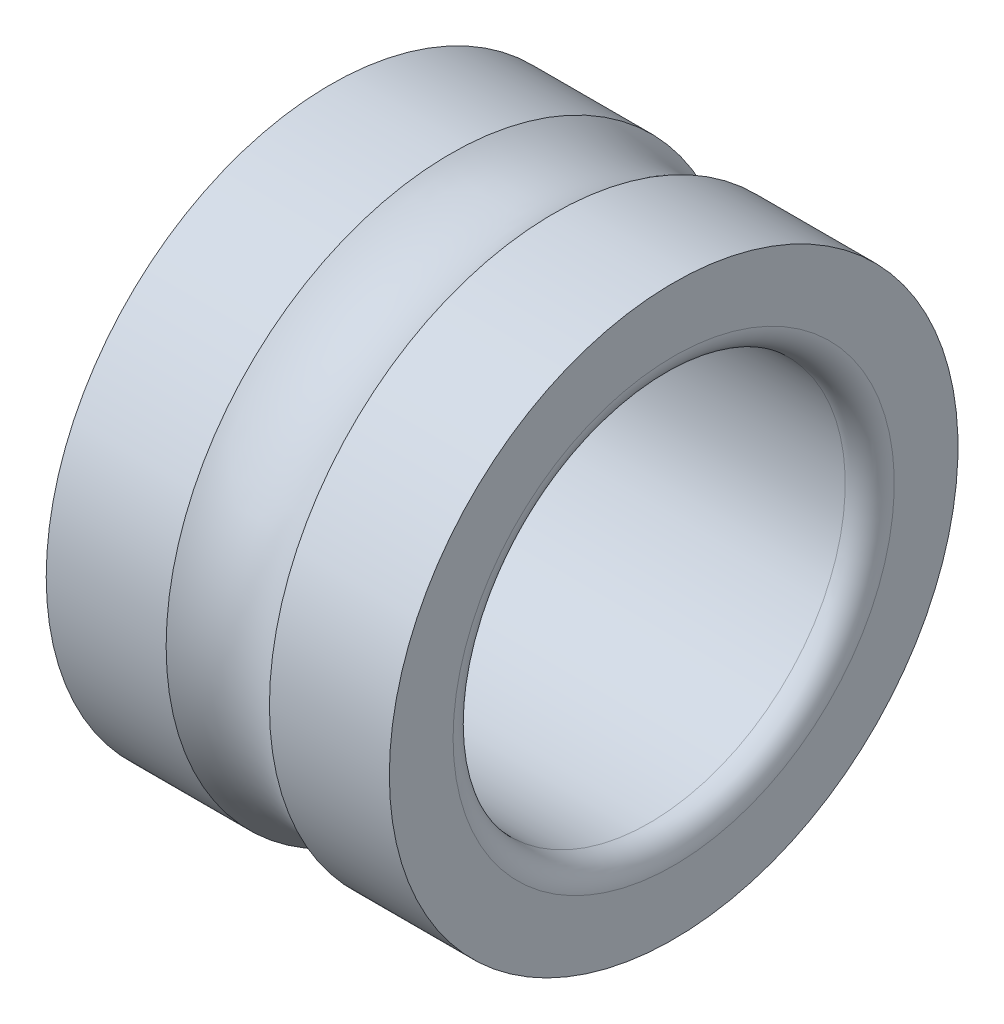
ISO-10303-21;
HEADER;
FILE_DESCRIPTION(('STEP AP214'),'2;1');
FILE_NAME('part.step','',(''),(''),'','','');
FILE_SCHEMA(('AUTOMOTIVE_DESIGN { 1 0 10303 214 1 1 1 1 }'));
ENDSEC;
DATA;
#1=APPLICATION_CONTEXT('core data for automotive mechanical design processes');
#2=APPLICATION_PROTOCOL_DEFINITION('international standard','automotive_design',2000,#1);
#3=PRODUCT_CONTEXT('',#1,'mechanical');
#4=PRODUCT('Part','Part','',(#3));
#5=PRODUCT_RELATED_PRODUCT_CATEGORY('part','',(#4));
#6=PRODUCT_DEFINITION_FORMATION('','',#4);
#7=PRODUCT_DEFINITION_CONTEXT('part definition',#1,'design');
#8=PRODUCT_DEFINITION('design','',#6,#7);
#9=PRODUCT_DEFINITION_SHAPE('','',#8);
#10=(LENGTH_UNIT() NAMED_UNIT(*) SI_UNIT(.MILLI.,.METRE.));
#11=(NAMED_UNIT(*) PLANE_ANGLE_UNIT() SI_UNIT($,.RADIAN.));
#12=(NAMED_UNIT(*) SI_UNIT($,.STERADIAN.) SOLID_ANGLE_UNIT());
#13=UNCERTAINTY_MEASURE_WITH_UNIT(LENGTH_MEASURE(1.E-05),#10,'distance_accuracy_value','');
#14=(GEOMETRIC_REPRESENTATION_CONTEXT(3) GLOBAL_UNCERTAINTY_ASSIGNED_CONTEXT((#13)) GLOBAL_UNIT_ASSIGNED_CONTEXT((#10,
#11,#12)) REPRESENTATION_CONTEXT('',''));
#15=CARTESIAN_POINT('',(0.,0.,0.));
#16=DIRECTION('',(0.,0.,1.));
#17=DIRECTION('',(1.,0.,0.));
#18=AXIS2_PLACEMENT_3D('',#15,#16,#17);
#19=CARTESIAN_POINT('',(-3.,0.,0.));
#20=DIRECTION('',(-1.,0.,0.));
#21=DIRECTION('',(0.,0.,1.));
#22=AXIS2_PLACEMENT_3D('',#19,#20,#21);
#23=TOROIDAL_SURFACE('',#22,4.5,0.5);
#24=CARTESIAN_POINT('',(-3.,0.,0.));
#25=DIRECTION('',(-1.,0.,0.));
#26=DIRECTION('',(0.,0.,1.));
#27=AXIS2_PLACEMENT_3D('',#24,#25,#26);
#28=CIRCLE('',#27,4.);
#29=CARTESIAN_POINT('',(-3.,0.,4.));
#30=VERTEX_POINT('',#29);
#31=EDGE_CURVE('E60',#30,#30,#28,.T.);
#32=ORIENTED_EDGE('',*,*,#31,.F.);
#33=EDGE_LOOP('',(#32));
#34=FACE_BOUND('',#33,.T.);
#35=CARTESIAN_POINT('',(-3.5,0.,0.));
#36=DIRECTION('',(-1.,0.,0.));
#37=DIRECTION('',(0.,0.,1.));
#38=AXIS2_PLACEMENT_3D('',#35,#36,#37);
#39=CIRCLE('',#38,4.5);
#40=CARTESIAN_POINT('',(-3.5,0.,4.5));
#41=VERTEX_POINT('',#40);
#42=EDGE_CURVE('E10',#41,#41,#39,.T.);
#43=ORIENTED_EDGE('',*,*,#42,.T.);
#44=EDGE_LOOP('',(#43));
#45=FACE_BOUND('',#44,.T.);
#46=ADVANCED_FACE('F32',(#34,#45),#23,.T.);
#47=CARTESIAN_POINT('',(-3.5,4.5,0.));
#48=DIRECTION('',(1.,0.,0.));
#49=DIRECTION('',(0.,0.,-1.));
#50=AXIS2_PLACEMENT_3D('',#47,#48,#49);
#51=PLANE('',#50);
#52=ORIENTED_EDGE('',*,*,#42,.F.);
#53=EDGE_LOOP('',(#52));
#54=FACE_BOUND('',#53,.T.);
#55=CARTESIAN_POINT('',(-3.5,0.,0.));
#56=DIRECTION('',(-1.,0.,0.));
#57=DIRECTION('',(0.,0.,1.));
#58=AXIS2_PLACEMENT_3D('',#55,#56,#57);
#59=CIRCLE('',#58,5.8);
#60=CARTESIAN_POINT('',(-3.5,0.,5.8));
#61=VERTEX_POINT('',#60);
#62=EDGE_CURVE('E38',#61,#61,#59,.T.);
#63=ORIENTED_EDGE('',*,*,#62,.T.);
#64=EDGE_LOOP('',(#63));
#65=FACE_BOUND('',#64,.T.);
#66=ADVANCED_FACE('F67',(#54,#65),#51,.F.);
#67=CARTESIAN_POINT('',(-4.37090809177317,0.,0.));
#68=DIRECTION('',(-1.,0.,0.));
#69=DIRECTION('',(0.,0.,1.));
#70=AXIS2_PLACEMENT_3D('',#67,#68,#69);
#71=CYLINDRICAL_SURFACE('',#70,5.8);
#72=ORIENTED_EDGE('',*,*,#62,.F.);
#73=EDGE_LOOP('',(#72));
#74=FACE_BOUND('',#73,.T.);
#75=CARTESIAN_POINT('',(-1.05356537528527,0.,0.));
#76=DIRECTION('',(-1.,0.,0.));
#77=DIRECTION('',(0.,0.,1.));
#78=AXIS2_PLACEMENT_3D('',#75,#76,#77);
#79=CIRCLE('',#78,5.8);
#80=CARTESIAN_POINT('',(-1.05356537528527,0.,5.8));
#81=VERTEX_POINT('',#80);
#82=EDGE_CURVE('E42',#81,#81,#79,.T.);
#83=ORIENTED_EDGE('',*,*,#82,.T.);
#84=EDGE_LOOP('',(#83));
#85=FACE_BOUND('',#84,.T.);
#86=ADVANCED_FACE('F71',(#74,#85),#71,.T.);
#87=CARTESIAN_POINT('',(0.,0.,0.));
#88=DIRECTION('',(-1.,0.,0.));
#89=DIRECTION('',(0.,0.,1.));
#90=AXIS2_PLACEMENT_3D('',#87,#88,#89);
#91=TOROIDAL_SURFACE('',#90,7.5,2.);
#92=ORIENTED_EDGE('',*,*,#82,.F.);
#93=EDGE_LOOP('',(#92));
#94=FACE_BOUND('',#93,.T.);
#95=CARTESIAN_POINT('',(1.05356537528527,0.,0.));
#96=DIRECTION('',(-1.,0.,0.));
#97=DIRECTION('',(0.,0.,1.));
#98=AXIS2_PLACEMENT_3D('',#95,#96,#97);
#99=CIRCLE('',#98,5.8);
#100=CARTESIAN_POINT('',(1.05356537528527,0.,5.8));
#101=VERTEX_POINT('',#100);
#102=EDGE_CURVE('E46',#101,#101,#99,.T.);
#103=ORIENTED_EDGE('',*,*,#102,.T.);
#104=EDGE_LOOP('',(#103));
#105=FACE_BOUND('',#104,.T.);
#106=ADVANCED_FACE('F76',(#94,#105),#91,.F.);
#107=CARTESIAN_POINT('',(-4.37090809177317,0.,0.));
#108=DIRECTION('',(-1.,0.,0.));
#109=DIRECTION('',(0.,0.,1.));
#110=AXIS2_PLACEMENT_3D('',#107,#108,#109);
#111=CYLINDRICAL_SURFACE('',#110,5.8);
#112=ORIENTED_EDGE('',*,*,#102,.F.);
#113=EDGE_LOOP('',(#112));
#114=FACE_BOUND('',#113,.T.);
#115=CARTESIAN_POINT('',(3.5,0.,0.));
#116=DIRECTION('',(-1.,0.,0.));
#117=DIRECTION('',(0.,0.,1.));
#118=AXIS2_PLACEMENT_3D('',#115,#116,#117);
#119=CIRCLE('',#118,5.8);
#120=CARTESIAN_POINT('',(3.5,0.,5.8));
#121=VERTEX_POINT('',#120);
#122=EDGE_CURVE('E51',#121,#121,#119,.T.);
#123=ORIENTED_EDGE('',*,*,#122,.T.);
#124=EDGE_LOOP('',(#123));
#125=FACE_BOUND('',#124,.T.);
#126=ADVANCED_FACE('F82',(#114,#125),#111,.T.);
#127=CARTESIAN_POINT('',(3.5,4.5,0.));
#128=DIRECTION('',(-1.,0.,0.));
#129=DIRECTION('',(0.,0.,1.));
#130=AXIS2_PLACEMENT_3D('',#127,#128,#129);
#131=PLANE('',#130);
#132=ORIENTED_EDGE('',*,*,#122,.F.);
#133=EDGE_LOOP('',(#132));
#134=FACE_BOUND('',#133,.T.);
#135=CARTESIAN_POINT('',(3.5,0.,0.));
#136=DIRECTION('',(-1.,0.,0.));
#137=DIRECTION('',(0.,0.,1.));
#138=AXIS2_PLACEMENT_3D('',#135,#136,#137);
#139=CIRCLE('',#138,4.5);
#140=CARTESIAN_POINT('',(3.5,0.,4.5));
#141=VERTEX_POINT('',#140);
#142=EDGE_CURVE('E54',#141,#141,#139,.T.);
#143=ORIENTED_EDGE('',*,*,#142,.T.);
#144=EDGE_LOOP('',(#143));
#145=FACE_BOUND('',#144,.T.);
#146=ADVANCED_FACE('F86',(#134,#145),#131,.F.);
#147=CARTESIAN_POINT('',(3.,0.,0.));
#148=DIRECTION('',(-1.,0.,0.));
#149=DIRECTION('',(0.,0.,1.));
#150=AXIS2_PLACEMENT_3D('',#147,#148,#149);
#151=TOROIDAL_SURFACE('',#150,4.5,0.5);
#152=ORIENTED_EDGE('',*,*,#142,.F.);
#153=EDGE_LOOP('',(#152));
#154=FACE_BOUND('',#153,.T.);
#155=CARTESIAN_POINT('',(3.,0.,0.));
#156=DIRECTION('',(-1.,0.,0.));
#157=DIRECTION('',(0.,0.,1.));
#158=AXIS2_PLACEMENT_3D('',#155,#156,#157);
#159=CIRCLE('',#158,4.);
#160=CARTESIAN_POINT('',(3.,0.,4.));
#161=VERTEX_POINT('',#160);
#162=EDGE_CURVE('E57',#161,#161,#159,.T.);
#163=ORIENTED_EDGE('',*,*,#162,.T.);
#164=EDGE_LOOP('',(#163));
#165=FACE_BOUND('',#164,.T.);
#166=ADVANCED_FACE('F90',(#154,#165),#151,.T.);
#167=CARTESIAN_POINT('',(-4.37090809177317,0.,0.));
#168=DIRECTION('',(-1.,0.,0.));
#169=DIRECTION('',(0.,0.,1.));
#170=AXIS2_PLACEMENT_3D('',#167,#168,#169);
#171=CYLINDRICAL_SURFACE('',#170,4.);
#172=ORIENTED_EDGE('',*,*,#162,.F.);
#173=EDGE_LOOP('',(#172));
#174=FACE_BOUND('',#173,.T.);
#175=ORIENTED_EDGE('',*,*,#31,.T.);
#176=EDGE_LOOP('',(#175));
#177=FACE_BOUND('',#176,.T.);
#178=ADVANCED_FACE('F64',(#174,#177),#171,.F.);
#179=CLOSED_SHELL('',(#46,#66,#86,#106,#126,#146,#166,#178));
#180=MANIFOLD_SOLID_BREP('B2',#179);
#181=ADVANCED_BREP_SHAPE_REPRESENTATION('',(#18,#180),#14);
#182=SHAPE_DEFINITION_REPRESENTATION(#9,#181);
ENDSEC;
END-ISO-10303-21;
